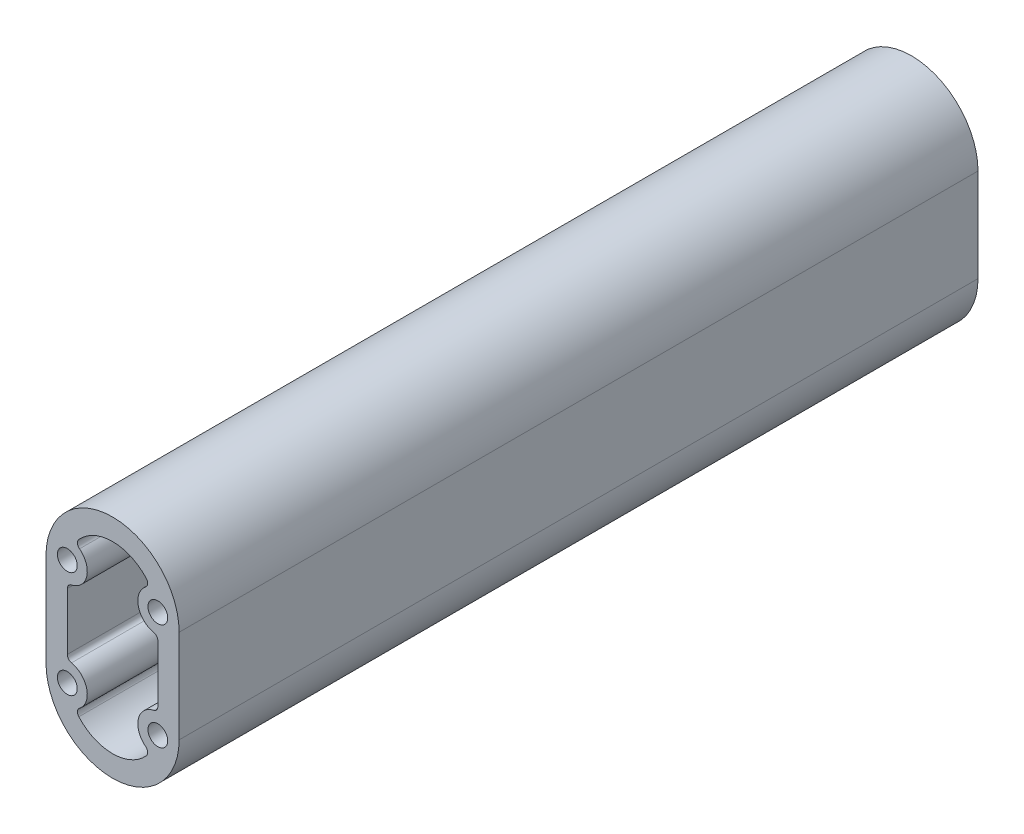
ISO-10303-21;
HEADER;
FILE_DESCRIPTION(('STEP AP214'),'2;1');
FILE_NAME('part.step','',(''),(''),'','','');
FILE_SCHEMA(('AUTOMOTIVE_DESIGN { 1 0 10303 214 1 1 1 1 }'));
ENDSEC;
DATA;
#1=APPLICATION_CONTEXT('core data for automotive mechanical design processes');
#2=APPLICATION_PROTOCOL_DEFINITION('international standard','automotive_design',2000,#1);
#3=PRODUCT_CONTEXT('',#1,'mechanical');
#4=PRODUCT('Part','Part','',(#3));
#5=PRODUCT_RELATED_PRODUCT_CATEGORY('part','',(#4));
#6=PRODUCT_DEFINITION_FORMATION('','',#4);
#7=PRODUCT_DEFINITION_CONTEXT('part definition',#1,'design');
#8=PRODUCT_DEFINITION('design','',#6,#7);
#9=PRODUCT_DEFINITION_SHAPE('','',#8);
#10=(LENGTH_UNIT() NAMED_UNIT(*) SI_UNIT(.MILLI.,.METRE.));
#11=(NAMED_UNIT(*) PLANE_ANGLE_UNIT() SI_UNIT($,.RADIAN.));
#12=(NAMED_UNIT(*) SI_UNIT($,.STERADIAN.) SOLID_ANGLE_UNIT());
#13=UNCERTAINTY_MEASURE_WITH_UNIT(LENGTH_MEASURE(1.E-05),#10,'distance_accuracy_value','');
#14=(GEOMETRIC_REPRESENTATION_CONTEXT(3) GLOBAL_UNCERTAINTY_ASSIGNED_CONTEXT((#13)) GLOBAL_UNIT_ASSIGNED_CONTEXT((#10,
#11,#12)) REPRESENTATION_CONTEXT('',''));
#15=CARTESIAN_POINT('',(0.,0.,0.));
#16=DIRECTION('',(0.,0.,1.));
#17=DIRECTION('',(1.,0.,0.));
#18=AXIS2_PLACEMENT_3D('',#15,#16,#17);
#19=CARTESIAN_POINT('',(0.,-17.5000000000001,300.));
#20=DIRECTION('',(0.,0.,1.));
#21=DIRECTION('',(1.,0.,0.));
#22=AXIS2_PLACEMENT_3D('',#19,#20,#21);
#23=PLANE('',#22);
#24=CARTESIAN_POINT('',(17.,20.,300.));
#25=DIRECTION('',(0.,0.,1.));
#26=DIRECTION('',(1.,0.,0.));
#27=AXIS2_PLACEMENT_3D('',#24,#25,#26);
#28=CIRCLE('',#27,3.72500000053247);
#29=CARTESIAN_POINT('',(20.7250000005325,20.,300.));
#30=VERTEX_POINT('',#29);
#31=EDGE_CURVE('E450',#30,#30,#28,.T.);
#32=ORIENTED_EDGE('',*,*,#31,.F.);
#33=EDGE_LOOP('',(#32));
#34=FACE_BOUND('',#33,.T.);
#35=CARTESIAN_POINT('',(17.,-20.,300.));
#36=DIRECTION('',(0.,0.,1.));
#37=DIRECTION('',(1.,0.,0.));
#38=AXIS2_PLACEMENT_3D('',#35,#36,#37);
#39=CIRCLE('',#38,3.72500000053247);
#40=CARTESIAN_POINT('',(20.7250000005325,-20.,300.));
#41=VERTEX_POINT('',#40);
#42=EDGE_CURVE('E223',#41,#41,#39,.T.);
#43=ORIENTED_EDGE('',*,*,#42,.F.);
#44=EDGE_LOOP('',(#43));
#45=FACE_BOUND('',#44,.T.);
#46=CARTESIAN_POINT('',(0.,-17.5000000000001,300.));
#47=DIRECTION('',(0.,0.,1.));
#48=DIRECTION('',(1.,0.,0.));
#49=AXIS2_PLACEMENT_3D('',#46,#47,#48);
#50=CIRCLE('',#49,25.);
#51=CARTESIAN_POINT('',(-25.,-17.5000000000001,300.));
#52=VERTEX_POINT('',#51);
#53=CARTESIAN_POINT('',(25.,-17.5,300.));
#54=VERTEX_POINT('',#53);
#55=EDGE_CURVE('E293',#52,#54,#50,.T.);
#56=ORIENTED_EDGE('',*,*,#55,.T.);
#57=DIRECTION('',(0.,1.,0.));
#58=VECTOR('',#57,1.);
#59=CARTESIAN_POINT('',(25.,-17.5,300.));
#60=LINE('',#59,#58);
#61=CARTESIAN_POINT('',(25.,17.5,300.));
#62=VERTEX_POINT('',#61);
#63=EDGE_CURVE('E296',#54,#62,#60,.T.);
#64=ORIENTED_EDGE('',*,*,#63,.T.);
#65=CARTESIAN_POINT('',(0.,17.5000000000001,300.));
#66=DIRECTION('',(0.,0.,1.));
#67=DIRECTION('',(1.,0.,0.));
#68=AXIS2_PLACEMENT_3D('',#65,#66,#67);
#69=CIRCLE('',#68,25.);
#70=CARTESIAN_POINT('',(-25.,17.5000000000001,300.));
#71=VERTEX_POINT('',#70);
#72=EDGE_CURVE('E299',#62,#71,#69,.T.);
#73=ORIENTED_EDGE('',*,*,#72,.T.);
#74=DIRECTION('',(0.,-1.,0.));
#75=VECTOR('',#74,1.);
#76=CARTESIAN_POINT('',(-25.,17.5000000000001,300.));
#77=LINE('',#76,#75);
#78=EDGE_CURVE('E301',#71,#52,#77,.T.);
#79=ORIENTED_EDGE('',*,*,#78,.T.);
#80=EDGE_LOOP('',(#56,#64,#73,#79));
#81=FACE_BOUND('',#80,.T.);
#82=DIRECTION('',(0.,1.,0.));
#83=VECTOR('',#82,1.);
#84=CARTESIAN_POINT('',(17.,-10.7129880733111,300.));
#85=LINE('',#84,#83);
#86=CARTESIAN_POINT('',(17.,-10.7129880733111,300.));
#87=VERTEX_POINT('',#86);
#88=CARTESIAN_POINT('',(17.,10.7131445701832,300.));
#89=VERTEX_POINT('',#88);
#90=EDGE_CURVE('E177',#87,#89,#85,.T.);
#91=ORIENTED_EDGE('',*,*,#90,.F.);
#92=CARTESIAN_POINT('',(15.,-10.7129880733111,300.));
#93=DIRECTION('',(0.,0.,1.));
#94=DIRECTION('',(1.,0.,0.));
#95=AXIS2_PLACEMENT_3D('',#92,#93,#94);
#96=CIRCLE('',#95,2.00000000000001);
#97=CARTESIAN_POINT('',(15.4210559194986,-12.6681637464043,300.));
#98=VERTEX_POINT('',#97);
#99=EDGE_CURVE('E169',#98,#87,#96,.T.);
#100=ORIENTED_EDGE('',*,*,#99,.F.);
#101=CARTESIAN_POINT('',(17.,-20.,300.));
#102=DIRECTION('',(0.,0.,-1.));
#103=DIRECTION('',(1.,0.,0.));
#104=AXIS2_PLACEMENT_3D('',#101,#102,#103);
#105=CIRCLE('',#104,7.49992581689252);
#106=CARTESIAN_POINT('',(12.4019247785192,-25.925081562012,300.));
#107=VERTEX_POINT('',#106);
#108=EDGE_CURVE('E220',#107,#98,#105,.T.);
#109=ORIENTED_EDGE('',*,*,#108,.F.);
#110=CARTESIAN_POINT('',(11.1757592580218,-27.5051189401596,300.));
#111=DIRECTION('',(0.,0.,1.));
#112=DIRECTION('',(1.,0.,0.));
#113=AXIS2_PLACEMENT_3D('',#110,#111,#112);
#114=CIRCLE('',#113,2.00000000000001);
#115=CARTESIAN_POINT('',(12.6658604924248,-28.8391347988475,300.));
#116=VERTEX_POINT('',#115);
#117=EDGE_CURVE('E218',#116,#107,#114,.T.);
#118=ORIENTED_EDGE('',*,*,#117,.F.);
#119=CARTESIAN_POINT('',(0.,-17.5000000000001,300.));
#120=DIRECTION('',(0.,0.,1.));
#121=DIRECTION('',(1.,0.,0.));
#122=AXIS2_PLACEMENT_3D('',#119,#120,#121);
#123=CIRCLE('',#122,17.);
#124=CARTESIAN_POINT('',(-12.6658604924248,-28.8391347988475,300.));
#125=VERTEX_POINT('',#124);
#126=EDGE_CURVE('E216',#125,#116,#123,.T.);
#127=ORIENTED_EDGE('',*,*,#126,.F.);
#128=CARTESIAN_POINT('',(-11.1757592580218,-27.5051189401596,300.));
#129=DIRECTION('',(0.,0.,1.));
#130=DIRECTION('',(1.,0.,0.));
#131=AXIS2_PLACEMENT_3D('',#128,#129,#130);
#132=CIRCLE('',#131,1.99999999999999);
#133=CARTESIAN_POINT('',(-12.4019247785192,-25.925081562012,300.));
#134=VERTEX_POINT('',#133);
#135=EDGE_CURVE('E214',#134,#125,#132,.T.);
#136=ORIENTED_EDGE('',*,*,#135,.F.);
#137=CARTESIAN_POINT('',(-17.,-20.,300.));
#138=DIRECTION('',(0.,0.,-1.));
#139=DIRECTION('',(1.,0.,0.));
#140=AXIS2_PLACEMENT_3D('',#137,#138,#139);
#141=CIRCLE('',#140,7.49992581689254);
#142=CARTESIAN_POINT('',(-15.4210559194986,-12.6681637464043,300.));
#143=VERTEX_POINT('',#142);
#144=EDGE_CURVE('E212',#143,#134,#141,.T.);
#145=ORIENTED_EDGE('',*,*,#144,.F.);
#146=CARTESIAN_POINT('',(-15.,-10.7129880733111,300.));
#147=DIRECTION('',(0.,0.,1.));
#148=DIRECTION('',(1.,0.,0.));
#149=AXIS2_PLACEMENT_3D('',#146,#147,#148);
#150=CIRCLE('',#149,1.99999999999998);
#151=CARTESIAN_POINT('',(-17.,-10.7129880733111,300.));
#152=VERTEX_POINT('',#151);
#153=EDGE_CURVE('E210',#152,#143,#150,.T.);
#154=ORIENTED_EDGE('',*,*,#153,.F.);
#155=DIRECTION('',(0.,-1.,0.));
#156=VECTOR('',#155,1.);
#157=CARTESIAN_POINT('',(-17.,10.7129880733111,300.));
#158=LINE('',#157,#156);
#159=CARTESIAN_POINT('',(-17.,10.7129880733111,300.));
#160=VERTEX_POINT('',#159);
#161=EDGE_CURVE('E208',#160,#152,#158,.T.);
#162=ORIENTED_EDGE('',*,*,#161,.F.);
#163=CARTESIAN_POINT('',(-15.,10.7129880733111,300.));
#164=DIRECTION('',(0.,0.,1.));
#165=DIRECTION('',(1.,0.,0.));
#166=AXIS2_PLACEMENT_3D('',#163,#164,#165);
#167=CIRCLE('',#166,1.99999999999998);
#168=CARTESIAN_POINT('',(-15.4210559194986,12.6681637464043,300.));
#169=VERTEX_POINT('',#168);
#170=EDGE_CURVE('E206',#169,#160,#167,.T.);
#171=ORIENTED_EDGE('',*,*,#170,.F.);
#172=CARTESIAN_POINT('',(-17.,20.,300.));
#173=DIRECTION('',(0.,0.,-1.));
#174=DIRECTION('',(1.,0.,0.));
#175=AXIS2_PLACEMENT_3D('',#172,#173,#174);
#176=CIRCLE('',#175,7.49992581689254);
#177=CARTESIAN_POINT('',(-12.4019247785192,25.9250815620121,300.));
#178=VERTEX_POINT('',#177);
#179=EDGE_CURVE('E204',#178,#169,#176,.T.);
#180=ORIENTED_EDGE('',*,*,#179,.F.);
#181=CARTESIAN_POINT('',(-11.1757592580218,27.5051189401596,300.));
#182=DIRECTION('',(0.,0.,1.));
#183=DIRECTION('',(1.,0.,0.));
#184=AXIS2_PLACEMENT_3D('',#181,#182,#183);
#185=CIRCLE('',#184,2.00000000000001);
#186=CARTESIAN_POINT('',(-12.6658604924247,28.8391347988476,300.));
#187=VERTEX_POINT('',#186);
#188=EDGE_CURVE('E202',#187,#178,#185,.T.);
#189=ORIENTED_EDGE('',*,*,#188,.F.);
#190=CARTESIAN_POINT('',(0.,17.5000000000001,300.));
#191=DIRECTION('',(0.,0.,1.));
#192=DIRECTION('',(1.,0.,0.));
#193=AXIS2_PLACEMENT_3D('',#190,#191,#192);
#194=CIRCLE('',#193,17.);
#195=CARTESIAN_POINT('',(12.6661980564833,28.8387577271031,300.));
#196=VERTEX_POINT('',#195);
#197=EDGE_CURVE('E200',#196,#187,#194,.T.);
#198=ORIENTED_EDGE('',*,*,#197,.F.);
#199=CARTESIAN_POINT('',(11.1760571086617,27.5047862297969,300.));
#200=DIRECTION('',(0.,0.,1.));
#201=DIRECTION('',(1.,0.,0.));
#202=AXIS2_PLACEMENT_3D('',#199,#200,#201);
#203=CIRCLE('',#202,2.);
#204=CARTESIAN_POINT('',(12.4023128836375,25.9248188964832,300.));
#205=VERTEX_POINT('',#204);
#206=EDGE_CURVE('E198',#205,#196,#203,.T.);
#207=ORIENTED_EDGE('',*,*,#206,.F.);
#208=CARTESIAN_POINT('',(17.0007265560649,20.,300.));
#209=DIRECTION('',(0.,0.,-1.));
#210=DIRECTION('',(1.,0.,0.));
#211=AXIS2_PLACEMENT_3D('',#208,#209,#210);
#212=CIRCLE('',#211,7.49992581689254);
#213=CARTESIAN_POINT('',(15.4212088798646,12.6682872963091,300.));
#214=VERTEX_POINT('',#213);
#215=EDGE_CURVE('E193',#214,#205,#212,.T.);
#216=ORIENTED_EDGE('',*,*,#215,.F.);
#217=CARTESIAN_POINT('',(15.,10.7131445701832,300.));
#218=DIRECTION('',(0.,0.,1.));
#219=DIRECTION('',(1.,0.,0.));
#220=AXIS2_PLACEMENT_3D('',#217,#218,#219);
#221=CIRCLE('',#220,2.);
#222=EDGE_CURVE('E191',#89,#214,#221,.T.);
#223=ORIENTED_EDGE('',*,*,#222,.F.);
#224=EDGE_LOOP('',(#91,#100,#109,#118,#127,#136,#145,#154,#162,#171,#180,#189,#198,#207,#216,#223));
#225=FACE_BOUND('',#224,.T.);
#226=CARTESIAN_POINT('',(-17.,-20.,300.));
#227=DIRECTION('',(0.,0.,1.));
#228=DIRECTION('',(1.,0.,0.));
#229=AXIS2_PLACEMENT_3D('',#226,#227,#228);
#230=CIRCLE('',#229,3.72500000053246);
#231=CARTESIAN_POINT('',(-13.2749999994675,-20.,300.));
#232=VERTEX_POINT('',#231);
#233=EDGE_CURVE('E456',#232,#232,#230,.T.);
#234=ORIENTED_EDGE('',*,*,#233,.F.);
#235=EDGE_LOOP('',(#234));
#236=FACE_BOUND('',#235,.T.);
#237=CARTESIAN_POINT('',(-17.,20.,300.));
#238=DIRECTION('',(0.,0.,1.));
#239=DIRECTION('',(1.,0.,0.));
#240=AXIS2_PLACEMENT_3D('',#237,#238,#239);
#241=CIRCLE('',#240,3.72500000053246);
#242=CARTESIAN_POINT('',(-13.2749999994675,20.,300.));
#243=VERTEX_POINT('',#242);
#244=EDGE_CURVE('E441',#243,#243,#241,.T.);
#245=ORIENTED_EDGE('',*,*,#244,.F.);
#246=EDGE_LOOP('',(#245));
#247=FACE_BOUND('',#246,.T.);
#248=ADVANCED_FACE('F32',(#34,#45,#81,#225,#236,#247),#23,.T.);
#249=CARTESIAN_POINT('',(0.,-17.5000000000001,0.));
#250=DIRECTION('',(0.,0.,1.));
#251=DIRECTION('',(1.,0.,0.));
#252=AXIS2_PLACEMENT_3D('',#249,#250,#251);
#253=PLANE('',#252);
#254=CARTESIAN_POINT('',(17.,20.,0.));
#255=DIRECTION('',(0.,0.,1.));
#256=DIRECTION('',(1.,0.,0.));
#257=AXIS2_PLACEMENT_3D('',#254,#255,#256);
#258=CIRCLE('',#257,3.72500000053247);
#259=CARTESIAN_POINT('',(20.7250000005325,20.,0.));
#260=VERTEX_POINT('',#259);
#261=EDGE_CURVE('E447',#260,#260,#258,.T.);
#262=ORIENTED_EDGE('',*,*,#261,.T.);
#263=EDGE_LOOP('',(#262));
#264=FACE_BOUND('',#263,.T.);
#265=CARTESIAN_POINT('',(17.,-20.,0.));
#266=DIRECTION('',(0.,0.,1.));
#267=DIRECTION('',(1.,0.,0.));
#268=AXIS2_PLACEMENT_3D('',#265,#266,#267);
#269=CIRCLE('',#268,3.72500000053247);
#270=CARTESIAN_POINT('',(20.7250000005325,-20.,0.));
#271=VERTEX_POINT('',#270);
#272=EDGE_CURVE('E459',#271,#271,#269,.T.);
#273=ORIENTED_EDGE('',*,*,#272,.T.);
#274=EDGE_LOOP('',(#273));
#275=FACE_BOUND('',#274,.T.);
#276=CARTESIAN_POINT('',(0.,-17.5000000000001,0.));
#277=DIRECTION('',(0.,0.,1.));
#278=DIRECTION('',(1.,0.,0.));
#279=AXIS2_PLACEMENT_3D('',#276,#277,#278);
#280=CIRCLE('',#279,25.);
#281=CARTESIAN_POINT('',(-25.,-17.5000000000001,0.));
#282=VERTEX_POINT('',#281);
#283=CARTESIAN_POINT('',(25.,-17.5,0.));
#284=VERTEX_POINT('',#283);
#285=EDGE_CURVE('E185',#282,#284,#280,.T.);
#286=ORIENTED_EDGE('',*,*,#285,.F.);
#287=DIRECTION('',(0.,-1.,0.));
#288=VECTOR('',#287,1.);
#289=CARTESIAN_POINT('',(-25.,17.5000000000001,0.));
#290=LINE('',#289,#288);
#291=CARTESIAN_POINT('',(-25.,17.5000000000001,0.));
#292=VERTEX_POINT('',#291);
#293=EDGE_CURVE('E297',#292,#282,#290,.T.);
#294=ORIENTED_EDGE('',*,*,#293,.F.);
#295=CARTESIAN_POINT('',(0.,17.5000000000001,0.));
#296=DIRECTION('',(0.,0.,1.));
#297=DIRECTION('',(1.,0.,0.));
#298=AXIS2_PLACEMENT_3D('',#295,#296,#297);
#299=CIRCLE('',#298,25.);
#300=CARTESIAN_POINT('',(25.,17.5,0.));
#301=VERTEX_POINT('',#300);
#302=EDGE_CURVE('E308',#301,#292,#299,.T.);
#303=ORIENTED_EDGE('',*,*,#302,.F.);
#304=DIRECTION('',(0.,1.,0.));
#305=VECTOR('',#304,1.);
#306=CARTESIAN_POINT('',(25.,-17.5,0.));
#307=LINE('',#306,#305);
#308=EDGE_CURVE('E306',#284,#301,#307,.T.);
#309=ORIENTED_EDGE('',*,*,#308,.F.);
#310=EDGE_LOOP('',(#286,#294,#303,#309));
#311=FACE_BOUND('',#310,.T.);
#312=CARTESIAN_POINT('',(15.,-10.7129880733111,0.));
#313=DIRECTION('',(0.,0.,1.));
#314=DIRECTION('',(1.,0.,0.));
#315=AXIS2_PLACEMENT_3D('',#312,#313,#314);
#316=CIRCLE('',#315,2.00000000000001);
#317=CARTESIAN_POINT('',(15.4210559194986,-12.6681637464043,0.));
#318=VERTEX_POINT('',#317);
#319=CARTESIAN_POINT('',(17.,-10.7129880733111,0.));
#320=VERTEX_POINT('',#319);
#321=EDGE_CURVE('E55',#318,#320,#316,.T.);
#322=ORIENTED_EDGE('',*,*,#321,.T.);
#323=DIRECTION('',(0.,1.,0.));
#324=VECTOR('',#323,1.);
#325=CARTESIAN_POINT('',(17.,-10.7129880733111,0.));
#326=LINE('',#325,#324);
#327=CARTESIAN_POINT('',(17.,10.7131445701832,0.));
#328=VERTEX_POINT('',#327);
#329=EDGE_CURVE('E184',#320,#328,#326,.T.);
#330=ORIENTED_EDGE('',*,*,#329,.T.);
#331=CARTESIAN_POINT('',(15.,10.7131445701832,0.));
#332=DIRECTION('',(0.,0.,1.));
#333=DIRECTION('',(1.,0.,0.));
#334=AXIS2_PLACEMENT_3D('',#331,#332,#333);
#335=CIRCLE('',#334,2.);
#336=CARTESIAN_POINT('',(15.4212088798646,12.6682872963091,0.));
#337=VERTEX_POINT('',#336);
#338=EDGE_CURVE('E225',#328,#337,#335,.T.);
#339=ORIENTED_EDGE('',*,*,#338,.T.);
#340=CARTESIAN_POINT('',(17.0007265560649,20.,0.));
#341=DIRECTION('',(0.,0.,-1.));
#342=DIRECTION('',(1.,0.,0.));
#343=AXIS2_PLACEMENT_3D('',#340,#341,#342);
#344=CIRCLE('',#343,7.49992581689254);
#345=CARTESIAN_POINT('',(12.4023128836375,25.9248188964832,0.));
#346=VERTEX_POINT('',#345);
#347=EDGE_CURVE('E228',#337,#346,#344,.T.);
#348=ORIENTED_EDGE('',*,*,#347,.T.);
#349=CARTESIAN_POINT('',(11.1760571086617,27.5047862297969,0.));
#350=DIRECTION('',(0.,0.,1.));
#351=DIRECTION('',(1.,0.,0.));
#352=AXIS2_PLACEMENT_3D('',#349,#350,#351);
#353=CIRCLE('',#352,2.);
#354=CARTESIAN_POINT('',(12.6661980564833,28.8387577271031,0.));
#355=VERTEX_POINT('',#354);
#356=EDGE_CURVE('E231',#346,#355,#353,.T.);
#357=ORIENTED_EDGE('',*,*,#356,.T.);
#358=CARTESIAN_POINT('',(0.,17.5000000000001,0.));
#359=DIRECTION('',(0.,0.,1.));
#360=DIRECTION('',(1.,0.,0.));
#361=AXIS2_PLACEMENT_3D('',#358,#359,#360);
#362=CIRCLE('',#361,17.);
#363=CARTESIAN_POINT('',(-12.6658604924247,28.8391347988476,0.));
#364=VERTEX_POINT('',#363);
#365=EDGE_CURVE('E234',#355,#364,#362,.T.);
#366=ORIENTED_EDGE('',*,*,#365,.T.);
#367=CARTESIAN_POINT('',(-11.1757592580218,27.5051189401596,0.));
#368=DIRECTION('',(0.,0.,1.));
#369=DIRECTION('',(1.,0.,0.));
#370=AXIS2_PLACEMENT_3D('',#367,#368,#369);
#371=CIRCLE('',#370,2.00000000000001);
#372=CARTESIAN_POINT('',(-12.4019247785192,25.9250815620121,0.));
#373=VERTEX_POINT('',#372);
#374=EDGE_CURVE('E237',#364,#373,#371,.T.);
#375=ORIENTED_EDGE('',*,*,#374,.T.);
#376=CARTESIAN_POINT('',(-17.,20.,0.));
#377=DIRECTION('',(0.,0.,-1.));
#378=DIRECTION('',(1.,0.,0.));
#379=AXIS2_PLACEMENT_3D('',#376,#377,#378);
#380=CIRCLE('',#379,7.49992581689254);
#381=CARTESIAN_POINT('',(-15.4210559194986,12.6681637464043,0.));
#382=VERTEX_POINT('',#381);
#383=EDGE_CURVE('E240',#373,#382,#380,.T.);
#384=ORIENTED_EDGE('',*,*,#383,.T.);
#385=CARTESIAN_POINT('',(-15.,10.7129880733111,0.));
#386=DIRECTION('',(0.,0.,1.));
#387=DIRECTION('',(1.,0.,0.));
#388=AXIS2_PLACEMENT_3D('',#385,#386,#387);
#389=CIRCLE('',#388,1.99999999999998);
#390=CARTESIAN_POINT('',(-17.,10.7129880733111,0.));
#391=VERTEX_POINT('',#390);
#392=EDGE_CURVE('E243',#382,#391,#389,.T.);
#393=ORIENTED_EDGE('',*,*,#392,.T.);
#394=DIRECTION('',(0.,-1.,0.));
#395=VECTOR('',#394,1.);
#396=CARTESIAN_POINT('',(-17.,10.7129880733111,0.));
#397=LINE('',#396,#395);
#398=CARTESIAN_POINT('',(-17.,-10.7129880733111,0.));
#399=VERTEX_POINT('',#398);
#400=EDGE_CURVE('E246',#391,#399,#397,.T.);
#401=ORIENTED_EDGE('',*,*,#400,.T.);
#402=CARTESIAN_POINT('',(-15.,-10.7129880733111,0.));
#403=DIRECTION('',(0.,0.,1.));
#404=DIRECTION('',(1.,0.,0.));
#405=AXIS2_PLACEMENT_3D('',#402,#403,#404);
#406=CIRCLE('',#405,1.99999999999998);
#407=CARTESIAN_POINT('',(-15.4210559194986,-12.6681637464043,0.));
#408=VERTEX_POINT('',#407);
#409=EDGE_CURVE('E249',#399,#408,#406,.T.);
#410=ORIENTED_EDGE('',*,*,#409,.T.);
#411=CARTESIAN_POINT('',(-17.,-20.,0.));
#412=DIRECTION('',(0.,0.,-1.));
#413=DIRECTION('',(1.,0.,0.));
#414=AXIS2_PLACEMENT_3D('',#411,#412,#413);
#415=CIRCLE('',#414,7.49992581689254);
#416=CARTESIAN_POINT('',(-12.4019247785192,-25.925081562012,0.));
#417=VERTEX_POINT('',#416);
#418=EDGE_CURVE('E252',#408,#417,#415,.T.);
#419=ORIENTED_EDGE('',*,*,#418,.T.);
#420=CARTESIAN_POINT('',(-11.1757592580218,-27.5051189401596,0.));
#421=DIRECTION('',(0.,0.,1.));
#422=DIRECTION('',(1.,0.,0.));
#423=AXIS2_PLACEMENT_3D('',#420,#421,#422);
#424=CIRCLE('',#423,1.99999999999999);
#425=CARTESIAN_POINT('',(-12.6658604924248,-28.8391347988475,0.));
#426=VERTEX_POINT('',#425);
#427=EDGE_CURVE('E255',#417,#426,#424,.T.);
#428=ORIENTED_EDGE('',*,*,#427,.T.);
#429=CARTESIAN_POINT('',(0.,-17.5000000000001,0.));
#430=DIRECTION('',(0.,0.,1.));
#431=DIRECTION('',(1.,0.,0.));
#432=AXIS2_PLACEMENT_3D('',#429,#430,#431);
#433=CIRCLE('',#432,17.);
#434=CARTESIAN_POINT('',(12.6658604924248,-28.8391347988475,0.));
#435=VERTEX_POINT('',#434);
#436=EDGE_CURVE('E258',#426,#435,#433,.T.);
#437=ORIENTED_EDGE('',*,*,#436,.T.);
#438=CARTESIAN_POINT('',(11.1757592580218,-27.5051189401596,0.));
#439=DIRECTION('',(0.,0.,1.));
#440=DIRECTION('',(1.,0.,0.));
#441=AXIS2_PLACEMENT_3D('',#438,#439,#440);
#442=CIRCLE('',#441,2.00000000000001);
#443=CARTESIAN_POINT('',(12.4019247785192,-25.925081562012,0.));
#444=VERTEX_POINT('',#443);
#445=EDGE_CURVE('E261',#435,#444,#442,.T.);
#446=ORIENTED_EDGE('',*,*,#445,.T.);
#447=CARTESIAN_POINT('',(17.,-20.,0.));
#448=DIRECTION('',(0.,0.,-1.));
#449=DIRECTION('',(1.,0.,0.));
#450=AXIS2_PLACEMENT_3D('',#447,#448,#449);
#451=CIRCLE('',#450,7.49992581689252);
#452=EDGE_CURVE('E178',#444,#318,#451,.T.);
#453=ORIENTED_EDGE('',*,*,#452,.T.);
#454=EDGE_LOOP('',(#322,#330,#339,#348,#357,#366,#375,#384,#393,#401,#410,#419,#428,#437,#446,#453));
#455=FACE_BOUND('',#454,.T.);
#456=CARTESIAN_POINT('',(-17.,-20.,0.));
#457=DIRECTION('',(0.,0.,1.));
#458=DIRECTION('',(1.,0.,0.));
#459=AXIS2_PLACEMENT_3D('',#456,#457,#458);
#460=CIRCLE('',#459,3.72500000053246);
#461=CARTESIAN_POINT('',(-13.2749999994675,-20.,0.));
#462=VERTEX_POINT('',#461);
#463=EDGE_CURVE('E453',#462,#462,#460,.T.);
#464=ORIENTED_EDGE('',*,*,#463,.T.);
#465=EDGE_LOOP('',(#464));
#466=FACE_BOUND('',#465,.T.);
#467=CARTESIAN_POINT('',(-17.,20.,0.));
#468=DIRECTION('',(0.,0.,1.));
#469=DIRECTION('',(1.,0.,0.));
#470=AXIS2_PLACEMENT_3D('',#467,#468,#469);
#471=CIRCLE('',#470,3.72500000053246);
#472=CARTESIAN_POINT('',(-13.2749999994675,20.,0.));
#473=VERTEX_POINT('',#472);
#474=EDGE_CURVE('E444',#473,#473,#471,.T.);
#475=ORIENTED_EDGE('',*,*,#474,.T.);
#476=EDGE_LOOP('',(#475));
#477=FACE_BOUND('',#476,.T.);
#478=ADVANCED_FACE('F326',(#264,#275,#311,#455,#466,#477),#253,.F.);
#479=CARTESIAN_POINT('',(0.,-17.5000000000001,300.));
#480=DIRECTION('',(0.,0.,-1.));
#481=DIRECTION('',(-1.,0.,0.));
#482=AXIS2_PLACEMENT_3D('',#479,#480,#481);
#483=CYLINDRICAL_SURFACE('',#482,25.);
#484=ORIENTED_EDGE('',*,*,#285,.T.);
#485=DIRECTION('',(0.,0.,-1.));
#486=VECTOR('',#485,1.);
#487=CARTESIAN_POINT('',(25.,-17.5,300.));
#488=LINE('',#487,#486);
#489=EDGE_CURVE('E11',#54,#284,#488,.T.);
#490=ORIENTED_EDGE('',*,*,#489,.F.);
#491=ORIENTED_EDGE('',*,*,#55,.F.);
#492=DIRECTION('',(0.,0.,-1.));
#493=VECTOR('',#492,1.);
#494=CARTESIAN_POINT('',(-25.,-17.5000000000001,300.));
#495=LINE('',#494,#493);
#496=EDGE_CURVE('E303',#52,#282,#495,.T.);
#497=ORIENTED_EDGE('',*,*,#496,.T.);
#498=EDGE_LOOP('',(#484,#490,#491,#497));
#499=FACE_BOUND('',#498,.T.);
#500=ADVANCED_FACE('F34',(#499),#483,.T.);
#501=CARTESIAN_POINT('',(25.,-17.5,300.));
#502=DIRECTION('',(-1.,0.,0.));
#503=DIRECTION('',(0.,0.,1.));
#504=AXIS2_PLACEMENT_3D('',#501,#502,#503);
#505=PLANE('',#504);
#506=ORIENTED_EDGE('',*,*,#308,.T.);
#507=DIRECTION('',(0.,0.,-1.));
#508=VECTOR('',#507,1.);
#509=CARTESIAN_POINT('',(25.,17.5,300.));
#510=LINE('',#509,#508);
#511=EDGE_CURVE('E40',#62,#301,#510,.T.);
#512=ORIENTED_EDGE('',*,*,#511,.F.);
#513=ORIENTED_EDGE('',*,*,#63,.F.);
#514=ORIENTED_EDGE('',*,*,#489,.T.);
#515=EDGE_LOOP('',(#506,#512,#513,#514));
#516=FACE_BOUND('',#515,.T.);
#517=ADVANCED_FACE('F336',(#516),#505,.F.);
#518=CARTESIAN_POINT('',(0.,17.5000000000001,300.));
#519=DIRECTION('',(0.,0.,-1.));
#520=DIRECTION('',(-1.,0.,0.));
#521=AXIS2_PLACEMENT_3D('',#518,#519,#520);
#522=CYLINDRICAL_SURFACE('',#521,25.);
#523=ORIENTED_EDGE('',*,*,#302,.T.);
#524=DIRECTION('',(0.,0.,-1.));
#525=VECTOR('',#524,1.);
#526=CARTESIAN_POINT('',(-25.,17.5000000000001,300.));
#527=LINE('',#526,#525);
#528=EDGE_CURVE('E313',#71,#292,#527,.T.);
#529=ORIENTED_EDGE('',*,*,#528,.F.);
#530=ORIENTED_EDGE('',*,*,#72,.F.);
#531=ORIENTED_EDGE('',*,*,#511,.T.);
#532=EDGE_LOOP('',(#523,#529,#530,#531));
#533=FACE_BOUND('',#532,.T.);
#534=ADVANCED_FACE('F320',(#533),#522,.T.);
#535=CARTESIAN_POINT('',(-25.,17.5000000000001,300.));
#536=DIRECTION('',(1.,0.,0.));
#537=DIRECTION('',(0.,0.,-1.));
#538=AXIS2_PLACEMENT_3D('',#535,#536,#537);
#539=PLANE('',#538);
#540=ORIENTED_EDGE('',*,*,#293,.T.);
#541=ORIENTED_EDGE('',*,*,#496,.F.);
#542=ORIENTED_EDGE('',*,*,#78,.F.);
#543=ORIENTED_EDGE('',*,*,#528,.T.);
#544=EDGE_LOOP('',(#540,#541,#542,#543));
#545=FACE_BOUND('',#544,.T.);
#546=ADVANCED_FACE('F330',(#545),#539,.F.);
#547=CARTESIAN_POINT('',(15.,-10.7129880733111,300.));
#548=DIRECTION('',(0.,0.,-1.));
#549=DIRECTION('',(-1.,0.,0.));
#550=AXIS2_PLACEMENT_3D('',#547,#548,#549);
#551=CYLINDRICAL_SURFACE('',#550,2.00000000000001);
#552=ORIENTED_EDGE('',*,*,#321,.F.);
#553=DIRECTION('',(0.,0.,-1.));
#554=VECTOR('',#553,1.);
#555=CARTESIAN_POINT('',(15.4210559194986,-12.6681637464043,300.));
#556=LINE('',#555,#554);
#557=EDGE_CURVE('E173',#98,#318,#556,.T.);
#558=ORIENTED_EDGE('',*,*,#557,.F.);
#559=ORIENTED_EDGE('',*,*,#99,.T.);
#560=DIRECTION('',(0.,0.,-1.));
#561=VECTOR('',#560,1.);
#562=CARTESIAN_POINT('',(17.,-10.7129880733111,300.));
#563=LINE('',#562,#561);
#564=EDGE_CURVE('E172',#87,#320,#563,.T.);
#565=ORIENTED_EDGE('',*,*,#564,.T.);
#566=EDGE_LOOP('',(#552,#558,#559,#565));
#567=FACE_BOUND('',#566,.T.);
#568=ADVANCED_FACE('F171',(#567),#551,.F.);
#569=CARTESIAN_POINT('',(17.,-10.7129880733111,300.));
#570=DIRECTION('',(-1.,0.,0.));
#571=DIRECTION('',(0.,-1.,0.));
#572=AXIS2_PLACEMENT_3D('',#569,#570,#571);
#573=PLANE('',#572);
#574=ORIENTED_EDGE('',*,*,#329,.F.);
#575=ORIENTED_EDGE('',*,*,#564,.F.);
#576=ORIENTED_EDGE('',*,*,#90,.T.);
#577=DIRECTION('',(0.,0.,-1.));
#578=VECTOR('',#577,1.);
#579=CARTESIAN_POINT('',(17.,10.7131445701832,300.));
#580=LINE('',#579,#578);
#581=EDGE_CURVE('E186',#89,#328,#580,.T.);
#582=ORIENTED_EDGE('',*,*,#581,.T.);
#583=EDGE_LOOP('',(#574,#575,#576,#582));
#584=FACE_BOUND('',#583,.T.);
#585=ADVANCED_FACE('F181',(#584),#573,.T.);
#586=CARTESIAN_POINT('',(15.,10.7131445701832,300.));
#587=DIRECTION('',(0.,0.,-1.));
#588=DIRECTION('',(-1.,0.,0.));
#589=AXIS2_PLACEMENT_3D('',#586,#587,#588);
#590=CYLINDRICAL_SURFACE('',#589,2.);
#591=ORIENTED_EDGE('',*,*,#338,.F.);
#592=ORIENTED_EDGE('',*,*,#581,.F.);
#593=ORIENTED_EDGE('',*,*,#222,.T.);
#594=DIRECTION('',(0.,0.,-1.));
#595=VECTOR('',#594,1.);
#596=CARTESIAN_POINT('',(15.4212088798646,12.6682872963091,300.));
#597=LINE('',#596,#595);
#598=EDGE_CURVE('E290',#214,#337,#597,.T.);
#599=ORIENTED_EDGE('',*,*,#598,.T.);
#600=EDGE_LOOP('',(#591,#592,#593,#599));
#601=FACE_BOUND('',#600,.T.);
#602=ADVANCED_FACE('F363',(#601),#590,.F.);
#603=CARTESIAN_POINT('',(17.0007265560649,20.,300.));
#604=DIRECTION('',(0.,0.,-1.));
#605=DIRECTION('',(-1.,0.,0.));
#606=AXIS2_PLACEMENT_3D('',#603,#604,#605);
#607=CYLINDRICAL_SURFACE('',#606,7.49992581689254);
#608=ORIENTED_EDGE('',*,*,#347,.F.);
#609=ORIENTED_EDGE('',*,*,#598,.F.);
#610=ORIENTED_EDGE('',*,*,#215,.T.);
#611=DIRECTION('',(0.,0.,-1.));
#612=VECTOR('',#611,1.);
#613=CARTESIAN_POINT('',(12.4023128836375,25.9248188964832,300.));
#614=LINE('',#613,#612);
#615=EDGE_CURVE('E288',#205,#346,#614,.T.);
#616=ORIENTED_EDGE('',*,*,#615,.T.);
#617=EDGE_LOOP('',(#608,#609,#610,#616));
#618=FACE_BOUND('',#617,.T.);
#619=ADVANCED_FACE('F367',(#618),#607,.T.);
#620=CARTESIAN_POINT('',(11.1760571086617,27.5047862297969,300.));
#621=DIRECTION('',(0.,0.,-1.));
#622=DIRECTION('',(-1.,0.,0.));
#623=AXIS2_PLACEMENT_3D('',#620,#621,#622);
#624=CYLINDRICAL_SURFACE('',#623,2.);
#625=ORIENTED_EDGE('',*,*,#356,.F.);
#626=ORIENTED_EDGE('',*,*,#615,.F.);
#627=ORIENTED_EDGE('',*,*,#206,.T.);
#628=DIRECTION('',(0.,0.,-1.));
#629=VECTOR('',#628,1.);
#630=CARTESIAN_POINT('',(12.6661980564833,28.8387577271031,300.));
#631=LINE('',#630,#629);
#632=EDGE_CURVE('E286',#196,#355,#631,.T.);
#633=ORIENTED_EDGE('',*,*,#632,.T.);
#634=EDGE_LOOP('',(#625,#626,#627,#633));
#635=FACE_BOUND('',#634,.T.);
#636=ADVANCED_FACE('F373',(#635),#624,.F.);
#637=CARTESIAN_POINT('',(0.,17.5000000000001,300.));
#638=DIRECTION('',(0.,0.,-1.));
#639=DIRECTION('',(-1.,0.,0.));
#640=AXIS2_PLACEMENT_3D('',#637,#638,#639);
#641=CYLINDRICAL_SURFACE('',#640,17.);
#642=ORIENTED_EDGE('',*,*,#365,.F.);
#643=ORIENTED_EDGE('',*,*,#632,.F.);
#644=ORIENTED_EDGE('',*,*,#197,.T.);
#645=DIRECTION('',(0.,0.,-1.));
#646=VECTOR('',#645,1.);
#647=CARTESIAN_POINT('',(-12.6658604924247,28.8391347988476,300.));
#648=LINE('',#647,#646);
#649=EDGE_CURVE('E284',#187,#364,#648,.T.);
#650=ORIENTED_EDGE('',*,*,#649,.T.);
#651=EDGE_LOOP('',(#642,#643,#644,#650));
#652=FACE_BOUND('',#651,.T.);
#653=ADVANCED_FACE('F377',(#652),#641,.F.);
#654=CARTESIAN_POINT('',(-11.1757592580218,27.5051189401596,300.));
#655=DIRECTION('',(0.,0.,-1.));
#656=DIRECTION('',(-1.,0.,0.));
#657=AXIS2_PLACEMENT_3D('',#654,#655,#656);
#658=CYLINDRICAL_SURFACE('',#657,2.00000000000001);
#659=ORIENTED_EDGE('',*,*,#374,.F.);
#660=ORIENTED_EDGE('',*,*,#649,.F.);
#661=ORIENTED_EDGE('',*,*,#188,.T.);
#662=DIRECTION('',(0.,0.,-1.));
#663=VECTOR('',#662,1.);
#664=CARTESIAN_POINT('',(-12.4019247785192,25.9250815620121,300.));
#665=LINE('',#664,#663);
#666=EDGE_CURVE('E282',#178,#373,#665,.T.);
#667=ORIENTED_EDGE('',*,*,#666,.T.);
#668=EDGE_LOOP('',(#659,#660,#661,#667));
#669=FACE_BOUND('',#668,.T.);
#670=ADVANCED_FACE('F381',(#669),#658,.F.);
#671=CARTESIAN_POINT('',(-17.,20.,300.));
#672=DIRECTION('',(0.,0.,-1.));
#673=DIRECTION('',(-1.,0.,0.));
#674=AXIS2_PLACEMENT_3D('',#671,#672,#673);
#675=CYLINDRICAL_SURFACE('',#674,7.49992581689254);
#676=ORIENTED_EDGE('',*,*,#383,.F.);
#677=ORIENTED_EDGE('',*,*,#666,.F.);
#678=ORIENTED_EDGE('',*,*,#179,.T.);
#679=DIRECTION('',(0.,0.,-1.));
#680=VECTOR('',#679,1.);
#681=CARTESIAN_POINT('',(-15.4210559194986,12.6681637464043,300.));
#682=LINE('',#681,#680);
#683=EDGE_CURVE('E280',#169,#382,#682,.T.);
#684=ORIENTED_EDGE('',*,*,#683,.T.);
#685=EDGE_LOOP('',(#676,#677,#678,#684));
#686=FACE_BOUND('',#685,.T.);
#687=ADVANCED_FACE('F385',(#686),#675,.T.);
#688=CARTESIAN_POINT('',(-15.,10.7129880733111,300.));
#689=DIRECTION('',(0.,0.,-1.));
#690=DIRECTION('',(-1.,0.,0.));
#691=AXIS2_PLACEMENT_3D('',#688,#689,#690);
#692=CYLINDRICAL_SURFACE('',#691,1.99999999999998);
#693=ORIENTED_EDGE('',*,*,#392,.F.);
#694=ORIENTED_EDGE('',*,*,#683,.F.);
#695=ORIENTED_EDGE('',*,*,#170,.T.);
#696=DIRECTION('',(0.,0.,-1.));
#697=VECTOR('',#696,1.);
#698=CARTESIAN_POINT('',(-17.,10.7129880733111,300.));
#699=LINE('',#698,#697);
#700=EDGE_CURVE('E278',#160,#391,#699,.T.);
#701=ORIENTED_EDGE('',*,*,#700,.T.);
#702=EDGE_LOOP('',(#693,#694,#695,#701));
#703=FACE_BOUND('',#702,.T.);
#704=ADVANCED_FACE('F389',(#703),#692,.F.);
#705=CARTESIAN_POINT('',(-17.,10.7129880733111,300.));
#706=DIRECTION('',(1.,0.,0.));
#707=DIRECTION('',(0.,0.,-1.));
#708=AXIS2_PLACEMENT_3D('',#705,#706,#707);
#709=PLANE('',#708);
#710=ORIENTED_EDGE('',*,*,#400,.F.);
#711=ORIENTED_EDGE('',*,*,#700,.F.);
#712=ORIENTED_EDGE('',*,*,#161,.T.);
#713=DIRECTION('',(0.,0.,-1.));
#714=VECTOR('',#713,1.);
#715=CARTESIAN_POINT('',(-17.,-10.7129880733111,300.));
#716=LINE('',#715,#714);
#717=EDGE_CURVE('E276',#152,#399,#716,.T.);
#718=ORIENTED_EDGE('',*,*,#717,.T.);
#719=EDGE_LOOP('',(#710,#711,#712,#718));
#720=FACE_BOUND('',#719,.T.);
#721=ADVANCED_FACE('F393',(#720),#709,.T.);
#722=CARTESIAN_POINT('',(-15.,-10.7129880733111,300.));
#723=DIRECTION('',(0.,0.,-1.));
#724=DIRECTION('',(-1.,0.,0.));
#725=AXIS2_PLACEMENT_3D('',#722,#723,#724);
#726=CYLINDRICAL_SURFACE('',#725,1.99999999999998);
#727=ORIENTED_EDGE('',*,*,#409,.F.);
#728=ORIENTED_EDGE('',*,*,#717,.F.);
#729=ORIENTED_EDGE('',*,*,#153,.T.);
#730=DIRECTION('',(0.,0.,-1.));
#731=VECTOR('',#730,1.);
#732=CARTESIAN_POINT('',(-15.4210559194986,-12.6681637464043,300.));
#733=LINE('',#732,#731);
#734=EDGE_CURVE('E274',#143,#408,#733,.T.);
#735=ORIENTED_EDGE('',*,*,#734,.T.);
#736=EDGE_LOOP('',(#727,#728,#729,#735));
#737=FACE_BOUND('',#736,.T.);
#738=ADVANCED_FACE('F397',(#737),#726,.F.);
#739=CARTESIAN_POINT('',(-17.,-20.,300.));
#740=DIRECTION('',(0.,0.,-1.));
#741=DIRECTION('',(-1.,0.,0.));
#742=AXIS2_PLACEMENT_3D('',#739,#740,#741);
#743=CYLINDRICAL_SURFACE('',#742,7.49992581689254);
#744=ORIENTED_EDGE('',*,*,#418,.F.);
#745=ORIENTED_EDGE('',*,*,#734,.F.);
#746=ORIENTED_EDGE('',*,*,#144,.T.);
#747=DIRECTION('',(0.,0.,-1.));
#748=VECTOR('',#747,1.);
#749=CARTESIAN_POINT('',(-12.4019247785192,-25.925081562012,300.));
#750=LINE('',#749,#748);
#751=EDGE_CURVE('E272',#134,#417,#750,.T.);
#752=ORIENTED_EDGE('',*,*,#751,.T.);
#753=EDGE_LOOP('',(#744,#745,#746,#752));
#754=FACE_BOUND('',#753,.T.);
#755=ADVANCED_FACE('F401',(#754),#743,.T.);
#756=CARTESIAN_POINT('',(-11.1757592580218,-27.5051189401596,300.));
#757=DIRECTION('',(0.,0.,-1.));
#758=DIRECTION('',(-1.,0.,0.));
#759=AXIS2_PLACEMENT_3D('',#756,#757,#758);
#760=CYLINDRICAL_SURFACE('',#759,1.99999999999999);
#761=ORIENTED_EDGE('',*,*,#427,.F.);
#762=ORIENTED_EDGE('',*,*,#751,.F.);
#763=ORIENTED_EDGE('',*,*,#135,.T.);
#764=DIRECTION('',(0.,0.,-1.));
#765=VECTOR('',#764,1.);
#766=CARTESIAN_POINT('',(-12.6658604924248,-28.8391347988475,300.));
#767=LINE('',#766,#765);
#768=EDGE_CURVE('E270',#125,#426,#767,.T.);
#769=ORIENTED_EDGE('',*,*,#768,.T.);
#770=EDGE_LOOP('',(#761,#762,#763,#769));
#771=FACE_BOUND('',#770,.T.);
#772=ADVANCED_FACE('F405',(#771),#760,.F.);
#773=CARTESIAN_POINT('',(0.,-17.5000000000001,300.));
#774=DIRECTION('',(0.,0.,-1.));
#775=DIRECTION('',(-1.,0.,0.));
#776=AXIS2_PLACEMENT_3D('',#773,#774,#775);
#777=CYLINDRICAL_SURFACE('',#776,17.);
#778=ORIENTED_EDGE('',*,*,#436,.F.);
#779=ORIENTED_EDGE('',*,*,#768,.F.);
#780=ORIENTED_EDGE('',*,*,#126,.T.);
#781=DIRECTION('',(0.,0.,-1.));
#782=VECTOR('',#781,1.);
#783=CARTESIAN_POINT('',(12.6658604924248,-28.8391347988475,300.));
#784=LINE('',#783,#782);
#785=EDGE_CURVE('E268',#116,#435,#784,.T.);
#786=ORIENTED_EDGE('',*,*,#785,.T.);
#787=EDGE_LOOP('',(#778,#779,#780,#786));
#788=FACE_BOUND('',#787,.T.);
#789=ADVANCED_FACE('F409',(#788),#777,.F.);
#790=CARTESIAN_POINT('',(11.1757592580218,-27.5051189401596,300.));
#791=DIRECTION('',(0.,0.,-1.));
#792=DIRECTION('',(-1.,0.,0.));
#793=AXIS2_PLACEMENT_3D('',#790,#791,#792);
#794=CYLINDRICAL_SURFACE('',#793,2.00000000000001);
#795=ORIENTED_EDGE('',*,*,#445,.F.);
#796=ORIENTED_EDGE('',*,*,#785,.F.);
#797=ORIENTED_EDGE('',*,*,#117,.T.);
#798=DIRECTION('',(0.,0.,-1.));
#799=VECTOR('',#798,1.);
#800=CARTESIAN_POINT('',(12.4019247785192,-25.925081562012,300.));
#801=LINE('',#800,#799);
#802=EDGE_CURVE('E47',#107,#444,#801,.T.);
#803=ORIENTED_EDGE('',*,*,#802,.T.);
#804=EDGE_LOOP('',(#795,#796,#797,#803));
#805=FACE_BOUND('',#804,.T.);
#806=ADVANCED_FACE('F413',(#805),#794,.F.);
#807=CARTESIAN_POINT('',(17.,-20.,300.));
#808=DIRECTION('',(0.,0.,-1.));
#809=DIRECTION('',(-1.,0.,0.));
#810=AXIS2_PLACEMENT_3D('',#807,#808,#809);
#811=CYLINDRICAL_SURFACE('',#810,7.49992581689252);
#812=ORIENTED_EDGE('',*,*,#452,.F.);
#813=ORIENTED_EDGE('',*,*,#802,.F.);
#814=ORIENTED_EDGE('',*,*,#108,.T.);
#815=ORIENTED_EDGE('',*,*,#557,.T.);
#816=EDGE_LOOP('',(#812,#813,#814,#815));
#817=FACE_BOUND('',#816,.T.);
#818=ADVANCED_FACE('F417',(#817),#811,.T.);
#819=CARTESIAN_POINT('',(17.,-20.,300.));
#820=DIRECTION('',(0.,0.,-1.));
#821=DIRECTION('',(-1.,0.,0.));
#822=AXIS2_PLACEMENT_3D('',#819,#820,#821);
#823=CYLINDRICAL_SURFACE('',#822,3.72500000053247);
#824=ORIENTED_EDGE('',*,*,#42,.T.);
#825=EDGE_LOOP('',(#824));
#826=FACE_BOUND('',#825,.T.);
#827=ORIENTED_EDGE('',*,*,#272,.F.);
#828=EDGE_LOOP('',(#827));
#829=FACE_BOUND('',#828,.T.);
#830=ADVANCED_FACE('F421',(#826,#829),#823,.F.);
#831=CARTESIAN_POINT('',(-17.,-20.,300.));
#832=DIRECTION('',(0.,0.,-1.));
#833=DIRECTION('',(-1.,0.,0.));
#834=AXIS2_PLACEMENT_3D('',#831,#832,#833);
#835=CYLINDRICAL_SURFACE('',#834,3.72500000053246);
#836=ORIENTED_EDGE('',*,*,#233,.T.);
#837=EDGE_LOOP('',(#836));
#838=FACE_BOUND('',#837,.T.);
#839=ORIENTED_EDGE('',*,*,#463,.F.);
#840=EDGE_LOOP('',(#839));
#841=FACE_BOUND('',#840,.T.);
#842=ADVANCED_FACE('F424',(#838,#841),#835,.F.);
#843=CARTESIAN_POINT('',(17.,20.,300.));
#844=DIRECTION('',(0.,0.,-1.));
#845=DIRECTION('',(-1.,0.,0.));
#846=AXIS2_PLACEMENT_3D('',#843,#844,#845);
#847=CYLINDRICAL_SURFACE('',#846,3.72500000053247);
#848=ORIENTED_EDGE('',*,*,#31,.T.);
#849=EDGE_LOOP('',(#848));
#850=FACE_BOUND('',#849,.T.);
#851=ORIENTED_EDGE('',*,*,#261,.F.);
#852=EDGE_LOOP('',(#851));
#853=FACE_BOUND('',#852,.T.);
#854=ADVANCED_FACE('F428',(#850,#853),#847,.F.);
#855=CARTESIAN_POINT('',(-17.,20.,300.));
#856=DIRECTION('',(0.,0.,-1.));
#857=DIRECTION('',(-1.,0.,0.));
#858=AXIS2_PLACEMENT_3D('',#855,#856,#857);
#859=CYLINDRICAL_SURFACE('',#858,3.72500000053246);
#860=ORIENTED_EDGE('',*,*,#244,.T.);
#861=EDGE_LOOP('',(#860));
#862=FACE_BOUND('',#861,.T.);
#863=ORIENTED_EDGE('',*,*,#474,.F.);
#864=EDGE_LOOP('',(#863));
#865=FACE_BOUND('',#864,.T.);
#866=ADVANCED_FACE('F432',(#862,#865),#859,.F.);
#867=CLOSED_SHELL('',(#248,#478,#500,#517,#534,#546,#568,#585,#602,#619,#636,#653,#670,#687,
#704,#721,#738,#755,#772,#789,#806,#818,#830,#842,#854,#866));
#868=MANIFOLD_SOLID_BREP('B2',#867);
#869=ADVANCED_BREP_SHAPE_REPRESENTATION('',(#18,#868),#14);
#870=SHAPE_DEFINITION_REPRESENTATION(#9,#869);
ENDSEC;
END-ISO-10303-21;
